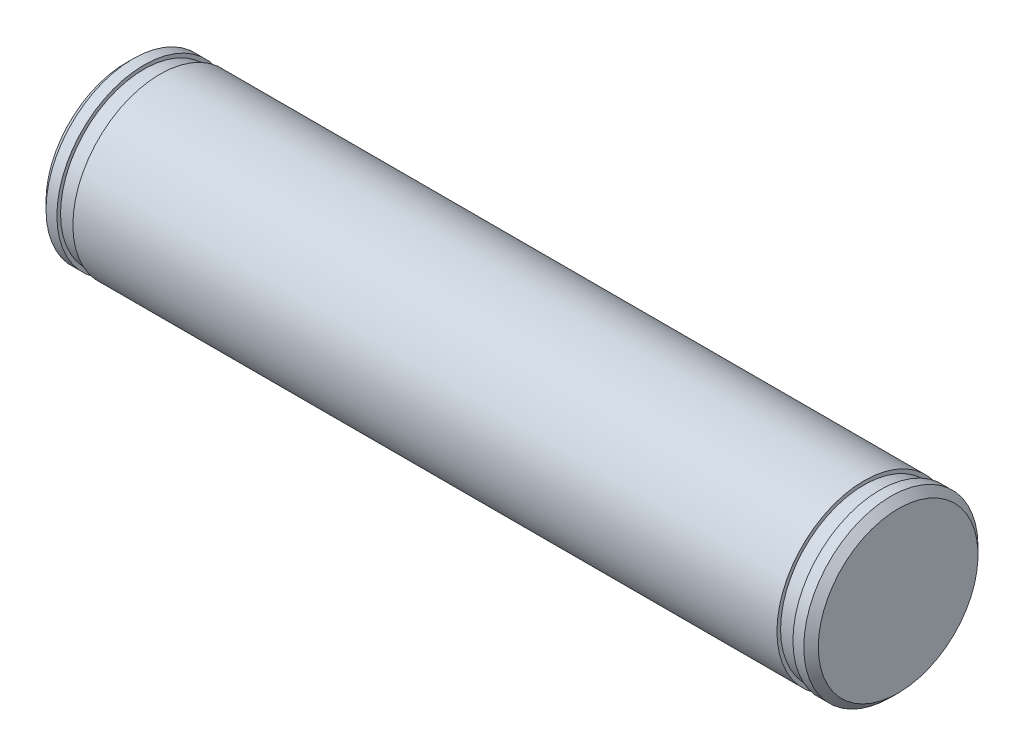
from build123d import *


with BuildPart() as part:
    # Esquisse2 → R_volution1 (revolve)
    with BuildSketch(Plane.XY, mode=Mode.PRIVATE) as r_volution1_sk:
        Polygon((0, 0), (0, 5.5), (0.5, 6), (1.25, 6), (1.25, 5.75), (2.35, 5.75), (2.35, 6), (50.85, 6), (50.85, 5.75), (51.95, 5.75), (51.95, 6), (52.7, 6), (53.2, 5.5), (53.2, 0), align=None)
    revolve(r_volution1_sk.sketch.rotate(Axis((-14.239877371, 0, 0), (1, 0, 0)), 90), axis=Axis((-14.239877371, 0, 0), (1, 0, 0)))


solid = part.part
